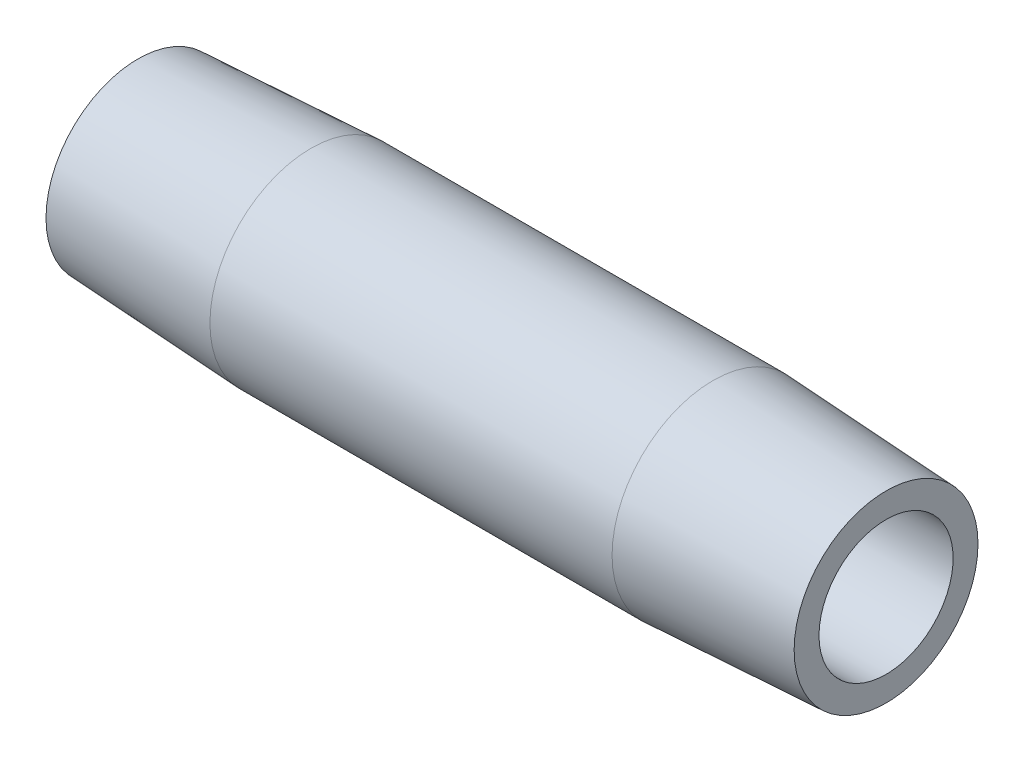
ISO-10303-21;
HEADER;
FILE_DESCRIPTION(('STEP AP214'),'2;1');
FILE_NAME('part.step','',(''),(''),'','','');
FILE_SCHEMA(('AUTOMOTIVE_DESIGN { 1 0 10303 214 1 1 1 1 }'));
ENDSEC;
DATA;
#1=APPLICATION_CONTEXT('core data for automotive mechanical design processes');
#2=APPLICATION_PROTOCOL_DEFINITION('international standard','automotive_design',2000,#1);
#3=PRODUCT_CONTEXT('',#1,'mechanical');
#4=PRODUCT('Part','Part','',(#3));
#5=PRODUCT_RELATED_PRODUCT_CATEGORY('part','',(#4));
#6=PRODUCT_DEFINITION_FORMATION('','',#4);
#7=PRODUCT_DEFINITION_CONTEXT('part definition',#1,'design');
#8=PRODUCT_DEFINITION('design','',#6,#7);
#9=PRODUCT_DEFINITION_SHAPE('','',#8);
#10=(LENGTH_UNIT() NAMED_UNIT(*) SI_UNIT(.MILLI.,.METRE.));
#11=(NAMED_UNIT(*) PLANE_ANGLE_UNIT() SI_UNIT($,.RADIAN.));
#12=(NAMED_UNIT(*) SI_UNIT($,.STERADIAN.) SOLID_ANGLE_UNIT());
#13=UNCERTAINTY_MEASURE_WITH_UNIT(LENGTH_MEASURE(1.E-05),#10,'distance_accuracy_value','');
#14=(GEOMETRIC_REPRESENTATION_CONTEXT(3) GLOBAL_UNCERTAINTY_ASSIGNED_CONTEXT((#13)) GLOBAL_UNIT_ASSIGNED_CONTEXT((#10,
#11,#12)) REPRESENTATION_CONTEXT('',''));
#15=CARTESIAN_POINT('',(0.,0.,0.));
#16=DIRECTION('',(0.,0.,1.));
#17=DIRECTION('',(1.,0.,0.));
#18=AXIS2_PLACEMENT_3D('',#15,#16,#17);
#19=CARTESIAN_POINT('',(0.476141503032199,0.,0.));
#20=DIRECTION('',(-1.,0.,0.));
#21=DIRECTION('',(0.,0.,1.));
#22=AXIS2_PLACEMENT_3D('',#19,#20,#21);
#23=CYLINDRICAL_SURFACE('',#22,5.14349999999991);
#24=CARTESIAN_POINT('',(8.8100393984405,0.,0.));
#25=DIRECTION('',(-1.,0.,0.));
#26=DIRECTION('',(0.,0.,1.));
#27=AXIS2_PLACEMENT_3D('',#24,#25,#26);
#28=CIRCLE('',#27,5.14349999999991);
#29=CARTESIAN_POINT('',(8.8100393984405,0.,5.14349999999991));
#30=VERTEX_POINT('',#29);
#31=EDGE_CURVE('E10',#30,#30,#28,.T.);
#32=ORIENTED_EDGE('',*,*,#31,.F.);
#33=EDGE_LOOP('',(#32));
#34=FACE_BOUND('',#33,.T.);
#35=CARTESIAN_POINT('',(29.2899606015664,0.,0.));
#36=DIRECTION('',(-1.,0.,0.));
#37=DIRECTION('',(0.,0.,1.));
#38=AXIS2_PLACEMENT_3D('',#35,#36,#37);
#39=CIRCLE('',#38,5.14349999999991);
#40=CARTESIAN_POINT('',(29.2899606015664,0.,5.14349999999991));
#41=VERTEX_POINT('',#40);
#42=EDGE_CURVE('E52',#41,#41,#39,.T.);
#43=ORIENTED_EDGE('',*,*,#42,.T.);
#44=EDGE_LOOP('',(#43));
#45=FACE_BOUND('',#44,.T.);
#46=ADVANCED_FACE('F30',(#34,#45),#23,.T.);
#47=CARTESIAN_POINT('',(8.8100393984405,0.,0.));
#48=DIRECTION('',(1.,0.,0.));
#49=DIRECTION('',(0.,0.,-1.));
#50=AXIS2_PLACEMENT_3D('',#47,#48,#49);
#51=CONICAL_SURFACE('',#50,5.14349999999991,0.0523598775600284);
#52=CARTESIAN_POINT('',(0.,0.,0.));
#53=DIRECTION('',(-1.,0.,0.));
#54=DIRECTION('',(0.,0.,1.));
#55=AXIS2_PLACEMENT_3D('',#52,#53,#54);
#56=CIRCLE('',#55,4.68178539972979);
#57=CARTESIAN_POINT('',(0.,0.,4.68178539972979));
#58=VERTEX_POINT('',#57);
#59=EDGE_CURVE('E36',#58,#58,#56,.T.);
#60=ORIENTED_EDGE('',*,*,#59,.F.);
#61=EDGE_LOOP('',(#60));
#62=FACE_BOUND('',#61,.T.);
#63=ORIENTED_EDGE('',*,*,#31,.T.);
#64=EDGE_LOOP('',(#63));
#65=FACE_BOUND('',#64,.T.);
#66=ADVANCED_FACE('F77',(#62,#65),#51,.T.);
#67=CARTESIAN_POINT('',(0.,4.68178539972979,0.));
#68=DIRECTION('',(1.,0.,0.));
#69=DIRECTION('',(0.,0.,-1.));
#70=AXIS2_PLACEMENT_3D('',#67,#68,#69);
#71=PLANE('',#70);
#72=CARTESIAN_POINT('',(0.,0.,0.));
#73=DIRECTION('',(-1.,0.,0.));
#74=DIRECTION('',(0.,0.,1.));
#75=AXIS2_PLACEMENT_3D('',#72,#73,#74);
#76=CIRCLE('',#75,3.4163);
#77=CARTESIAN_POINT('',(0.,0.,3.4163));
#78=VERTEX_POINT('',#77);
#79=EDGE_CURVE('E40',#78,#78,#76,.T.);
#80=ORIENTED_EDGE('',*,*,#79,.F.);
#81=EDGE_LOOP('',(#80));
#82=FACE_BOUND('',#81,.T.);
#83=ORIENTED_EDGE('',*,*,#59,.T.);
#84=EDGE_LOOP('',(#83));
#85=FACE_BOUND('',#84,.T.);
#86=ADVANCED_FACE('F72',(#82,#85),#71,.F.);
#87=CARTESIAN_POINT('',(0.476141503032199,0.,0.));
#88=DIRECTION('',(-1.,0.,0.));
#89=DIRECTION('',(0.,0.,1.));
#90=AXIS2_PLACEMENT_3D('',#87,#88,#89);
#91=CYLINDRICAL_SURFACE('',#90,3.4163);
#92=CARTESIAN_POINT('',(38.1,0.,0.));
#93=DIRECTION('',(-1.,0.,0.));
#94=DIRECTION('',(0.,0.,1.));
#95=AXIS2_PLACEMENT_3D('',#92,#93,#94);
#96=CIRCLE('',#95,3.4163);
#97=CARTESIAN_POINT('',(38.1,0.,3.4163));
#98=VERTEX_POINT('',#97);
#99=EDGE_CURVE('E44',#98,#98,#96,.T.);
#100=ORIENTED_EDGE('',*,*,#99,.F.);
#101=EDGE_LOOP('',(#100));
#102=FACE_BOUND('',#101,.T.);
#103=ORIENTED_EDGE('',*,*,#79,.T.);
#104=EDGE_LOOP('',(#103));
#105=FACE_BOUND('',#104,.T.);
#106=ADVANCED_FACE('F66',(#102,#105),#91,.F.);
#107=CARTESIAN_POINT('',(38.1,3.4163,0.));
#108=DIRECTION('',(-1.,0.,0.));
#109=DIRECTION('',(0.,0.,1.));
#110=AXIS2_PLACEMENT_3D('',#107,#108,#109);
#111=PLANE('',#110);
#112=CARTESIAN_POINT('',(38.1,0.,0.));
#113=DIRECTION('',(-1.,0.,0.));
#114=DIRECTION('',(0.,0.,1.));
#115=AXIS2_PLACEMENT_3D('',#112,#113,#114);
#116=CIRCLE('',#115,4.68178539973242);
#117=CARTESIAN_POINT('',(38.1,0.,4.68178539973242));
#118=VERTEX_POINT('',#117);
#119=EDGE_CURVE('E49',#118,#118,#116,.T.);
#120=ORIENTED_EDGE('',*,*,#119,.F.);
#121=EDGE_LOOP('',(#120));
#122=FACE_BOUND('',#121,.T.);
#123=ORIENTED_EDGE('',*,*,#99,.T.);
#124=EDGE_LOOP('',(#123));
#125=FACE_BOUND('',#124,.T.);
#126=ADVANCED_FACE('F60',(#122,#125),#111,.F.);
#127=CARTESIAN_POINT('',(38.1,0.,0.));
#128=DIRECTION('',(-1.,0.,0.));
#129=DIRECTION('',(0.,0.,1.));
#130=AXIS2_PLACEMENT_3D('',#127,#128,#129);
#131=CONICAL_SURFACE('',#130,4.68178539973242,0.0523598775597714);
#132=ORIENTED_EDGE('',*,*,#42,.F.);
#133=EDGE_LOOP('',(#132));
#134=FACE_BOUND('',#133,.T.);
#135=ORIENTED_EDGE('',*,*,#119,.T.);
#136=EDGE_LOOP('',(#135));
#137=FACE_BOUND('',#136,.T.);
#138=ADVANCED_FACE('F57',(#134,#137),#131,.T.);
#139=CLOSED_SHELL('',(#46,#66,#86,#106,#126,#138));
#140=MANIFOLD_SOLID_BREP('B2',#139);
#141=ADVANCED_BREP_SHAPE_REPRESENTATION('',(#18,#140),#14);
#142=SHAPE_DEFINITION_REPRESENTATION(#9,#141);
ENDSEC;
END-ISO-10303-21;
